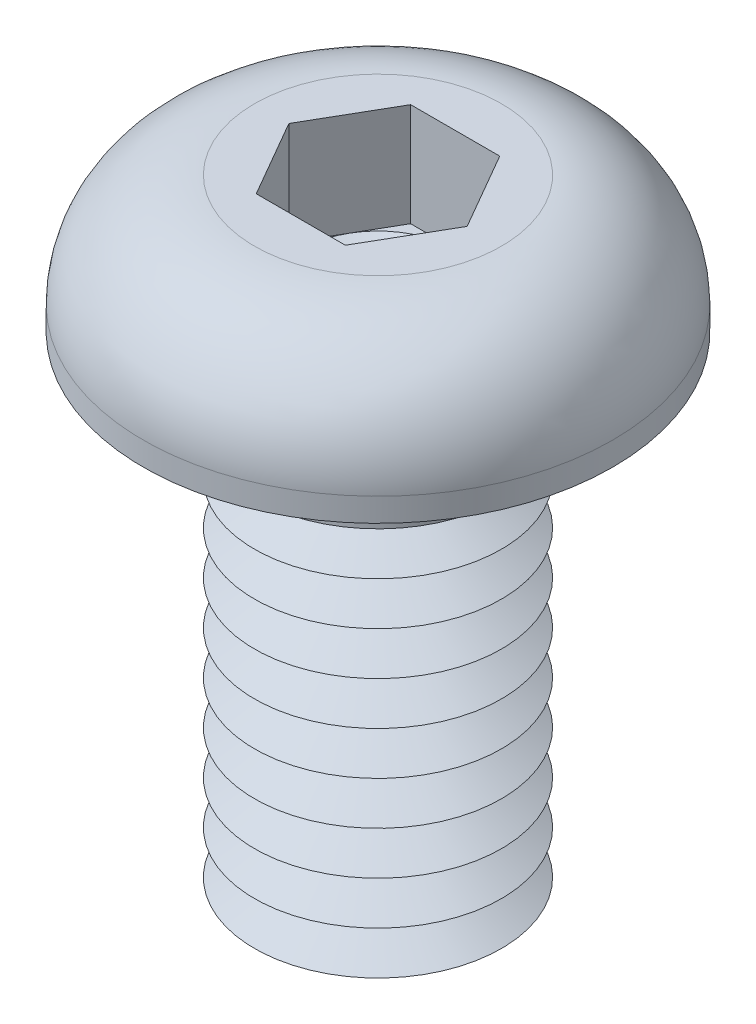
ISO-10303-21;
HEADER;
FILE_DESCRIPTION(('STEP AP214'),'2;1');
FILE_NAME('part.step','',(''),(''),'','','');
FILE_SCHEMA(('AUTOMOTIVE_DESIGN { 1 0 10303 214 1 1 1 1 }'));
ENDSEC;
DATA;
#1=APPLICATION_CONTEXT('core data for automotive mechanical design processes');
#2=APPLICATION_PROTOCOL_DEFINITION('international standard','automotive_design',2000,#1);
#3=PRODUCT_CONTEXT('',#1,'mechanical');
#4=PRODUCT('Part','Part','',(#3));
#5=PRODUCT_RELATED_PRODUCT_CATEGORY('part','',(#4));
#6=PRODUCT_DEFINITION_FORMATION('','',#4);
#7=PRODUCT_DEFINITION_CONTEXT('part definition',#1,'design');
#8=PRODUCT_DEFINITION('design','',#6,#7);
#9=PRODUCT_DEFINITION_SHAPE('','',#8);
#10=(LENGTH_UNIT() NAMED_UNIT(*) SI_UNIT(.MILLI.,.METRE.));
#11=(NAMED_UNIT(*) PLANE_ANGLE_UNIT() SI_UNIT($,.RADIAN.));
#12=(NAMED_UNIT(*) SI_UNIT($,.STERADIAN.) SOLID_ANGLE_UNIT());
#13=UNCERTAINTY_MEASURE_WITH_UNIT(LENGTH_MEASURE(1.E-05),#10,'distance_accuracy_value','');
#14=(GEOMETRIC_REPRESENTATION_CONTEXT(3) GLOBAL_UNCERTAINTY_ASSIGNED_CONTEXT((#13)) GLOBAL_UNIT_ASSIGNED_CONTEXT((#10,
#11,#12)) REPRESENTATION_CONTEXT('',''));
#15=CARTESIAN_POINT('',(0.,0.,0.));
#16=DIRECTION('',(0.,0.,1.));
#17=DIRECTION('',(1.,0.,0.));
#18=AXIS2_PLACEMENT_3D('',#15,#16,#17);
#19=CARTESIAN_POINT('',(0.,0.,0.));
#20=DIRECTION('',(0.,-1.,0.));
#21=DIRECTION('',(0.,0.,-1.));
#22=AXIS2_PLACEMENT_3D('',#19,#20,#21);
#23=TOROIDAL_SURFACE('',#22,2.35,0.35);
#24=CARTESIAN_POINT('',(0.,0.,-2.7));
#25=VERTEX_POINT('',#24);
#26=VERTEX_LOOP('',#25);
#27=FACE_BOUND('',#26,.T.);
#28=ADVANCED_FACE('P0_F12',(#27),#23,.T.);
#29=CLOSED_SHELL('',(#28));
#30=MANIFOLD_SOLID_BREP('P0_B1',#29);
#31=CARTESIAN_POINT('',(0.721687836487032,0.530000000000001,-1.25));
#32=DIRECTION('',(0.,1.,0.));
#33=DIRECTION('',(0.,0.,1.));
#34=AXIS2_PLACEMENT_3D('',#31,#32,#33);
#35=PLANE('',#34);
#36=CARTESIAN_POINT('',(0.,0.530000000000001,0.));
#37=DIRECTION('',(0.,1.,0.));
#38=DIRECTION('',(0.,0.,1.));
#39=AXIS2_PLACEMENT_3D('',#36,#37,#38);
#40=CIRCLE('',#39,1.25);
#41=CARTESIAN_POINT('',(0.,0.530000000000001,1.25));
#42=VERTEX_POINT('',#41);
#43=CARTESIAN_POINT('',(1.08253175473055,0.530000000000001,0.625));
#44=VERTEX_POINT('',#43);
#45=EDGE_CURVE('P1_E93',#42,#44,#40,.T.);
#46=ORIENTED_EDGE('',*,*,#45,.F.);
#47=DIRECTION('',(1.,0.,0.));
#48=VECTOR('',#47,1.);
#49=CARTESIAN_POINT('',(-0.721687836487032,0.530000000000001,1.25));
#50=LINE('',#49,#48);
#51=CARTESIAN_POINT('',(0.721687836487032,0.530000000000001,1.25));
#52=VERTEX_POINT('',#51);
#53=EDGE_CURVE('P1_E116',#42,#52,#50,.T.);
#54=ORIENTED_EDGE('',*,*,#53,.T.);
#55=DIRECTION('',(0.5,0.,-0.866025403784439));
#56=VECTOR('',#55,1.);
#57=CARTESIAN_POINT('',(0.721687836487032,0.530000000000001,1.25));
#58=LINE('',#57,#56);
#59=EDGE_CURVE('P1_E112',#52,#44,#58,.T.);
#60=ORIENTED_EDGE('',*,*,#59,.T.);
#61=EDGE_LOOP('',(#46,#54,#60));
#62=FACE_BOUND('',#61,.T.);
#63=ADVANCED_FACE('P1_F15',(#62),#35,.T.);
#64=CARTESIAN_POINT('',(0.,0.530000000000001,0.));
#65=DIRECTION('',(0.,1.,0.));
#66=DIRECTION('',(0.,0.,1.));
#67=AXIS2_PLACEMENT_3D('',#64,#65,#66);
#68=CIRCLE('',#67,1.25);
#69=CARTESIAN_POINT('',(1.08253175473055,0.530000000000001,-0.625));
#70=VERTEX_POINT('',#69);
#71=EDGE_CURVE('P1_E10',#44,#70,#68,.T.);
#72=ORIENTED_EDGE('',*,*,#71,.F.);
#73=CARTESIAN_POINT('',(1.44337567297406,0.530000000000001,0.));
#74=VERTEX_POINT('',#73);
#75=EDGE_CURVE('P1_E104',#44,#74,#58,.T.);
#76=ORIENTED_EDGE('',*,*,#75,.T.);
#77=DIRECTION('',(-0.5,0.,-0.866025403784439));
#78=VECTOR('',#77,1.);
#79=CARTESIAN_POINT('',(1.44337567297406,0.530000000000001,0.));
#80=LINE('',#79,#78);
#81=EDGE_CURVE('P1_E107',#74,#70,#80,.T.);
#82=ORIENTED_EDGE('',*,*,#81,.T.);
#83=EDGE_LOOP('',(#72,#76,#82));
#84=FACE_BOUND('',#83,.T.);
#85=ADVANCED_FACE('P1_F103',(#84),#35,.T.);
#86=CARTESIAN_POINT('',(0.,0.530000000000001,-1.25));
#87=VERTEX_POINT('',#86);
#88=EDGE_CURVE('P1_E24',#70,#87,#68,.T.);
#89=ORIENTED_EDGE('',*,*,#88,.F.);
#90=CARTESIAN_POINT('',(0.721687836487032,0.530000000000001,-1.25));
#91=VERTEX_POINT('',#90);
#92=EDGE_CURVE('P1_E139',#70,#91,#80,.T.);
#93=ORIENTED_EDGE('',*,*,#92,.T.);
#94=DIRECTION('',(-1.,0.,0.));
#95=VECTOR('',#94,1.);
#96=CARTESIAN_POINT('',(0.721687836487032,0.530000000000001,-1.25));
#97=LINE('',#96,#95);
#98=EDGE_CURVE('P1_E282',#91,#87,#97,.T.);
#99=ORIENTED_EDGE('',*,*,#98,.T.);
#100=EDGE_LOOP('',(#89,#93,#99));
#101=FACE_BOUND('',#100,.T.);
#102=ADVANCED_FACE('P1_F247',(#101),#35,.T.);
#103=CARTESIAN_POINT('',(-1.08253175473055,0.530000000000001,-0.625));
#104=VERTEX_POINT('',#103);
#105=EDGE_CURVE('P1_E277',#87,#104,#68,.T.);
#106=ORIENTED_EDGE('',*,*,#105,.F.);
#107=CARTESIAN_POINT('',(-0.721687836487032,0.530000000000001,-1.25));
#108=VERTEX_POINT('',#107);
#109=EDGE_CURVE('P1_E286',#87,#108,#97,.T.);
#110=ORIENTED_EDGE('',*,*,#109,.T.);
#111=DIRECTION('',(-0.5,0.,0.866025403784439));
#112=VECTOR('',#111,1.);
#113=CARTESIAN_POINT('',(-0.721687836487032,0.530000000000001,-1.25));
#114=LINE('',#113,#112);
#115=EDGE_CURVE('P1_E281',#108,#104,#114,.T.);
#116=ORIENTED_EDGE('',*,*,#115,.T.);
#117=EDGE_LOOP('',(#106,#110,#116));
#118=FACE_BOUND('',#117,.T.);
#119=ADVANCED_FACE('P1_F261',(#118),#35,.T.);
#120=CARTESIAN_POINT('',(-1.08253175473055,0.530000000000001,0.625));
#121=VERTEX_POINT('',#120);
#122=EDGE_CURVE('P1_E31',#104,#121,#68,.T.);
#123=ORIENTED_EDGE('',*,*,#122,.F.);
#124=CARTESIAN_POINT('',(-1.44337567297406,0.530000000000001,0.));
#125=VERTEX_POINT('',#124);
#126=EDGE_CURVE('P1_E273',#104,#125,#114,.T.);
#127=ORIENTED_EDGE('',*,*,#126,.T.);
#128=DIRECTION('',(0.5,0.,0.866025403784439));
#129=VECTOR('',#128,1.);
#130=CARTESIAN_POINT('',(-1.44337567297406,0.530000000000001,0.));
#131=LINE('',#130,#129);
#132=EDGE_CURVE('P1_E276',#125,#121,#131,.T.);
#133=ORIENTED_EDGE('',*,*,#132,.T.);
#134=EDGE_LOOP('',(#123,#127,#133));
#135=FACE_BOUND('',#134,.T.);
#136=ADVANCED_FACE('P1_F252',(#135),#35,.T.);
#137=CARTESIAN_POINT('',(0.,-7.3,0.));
#138=DIRECTION('',(0.,1.,0.));
#139=DIRECTION('',(0.,0.,1.));
#140=AXIS2_PLACEMENT_3D('',#137,#138,#139);
#141=CONICAL_SURFACE('',#140,1.39378221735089,1.0471975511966);
#142=CARTESIAN_POINT('',(0.,-6.95,0.));
#143=DIRECTION('',(0.,-1.,0.));
#144=DIRECTION('',(0.,0.,-1.));
#145=AXIS2_PLACEMENT_3D('',#142,#143,#144);
#146=CIRCLE('',#145,2.);
#147=CARTESIAN_POINT('',(0.,-6.95,-2.));
#148=VERTEX_POINT('',#147);
#149=EDGE_CURVE('P1_E209',#148,#148,#146,.T.);
#150=ORIENTED_EDGE('',*,*,#149,.T.);
#151=EDGE_LOOP('',(#150));
#152=FACE_BOUND('',#151,.T.);
#153=CARTESIAN_POINT('',(0.,-7.3,0.));
#154=DIRECTION('',(0.,-1.,0.));
#155=DIRECTION('',(0.,0.,-1.));
#156=AXIS2_PLACEMENT_3D('',#153,#154,#155);
#157=CIRCLE('',#156,1.39378221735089);
#158=CARTESIAN_POINT('',(0.,-7.3,-1.39378221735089));
#159=VERTEX_POINT('',#158);
#160=EDGE_CURVE('P1_E212',#159,#159,#157,.T.);
#161=ORIENTED_EDGE('',*,*,#160,.F.);
#162=EDGE_LOOP('',(#161));
#163=FACE_BOUND('',#162,.T.);
#164=ADVANCED_FACE('P1_F260',(#152,#163),#141,.T.);
#165=CARTESIAN_POINT('',(0.,-7.65,0.));
#166=DIRECTION('',(0.,-1.,0.));
#167=DIRECTION('',(0.,0.,-1.));
#168=AXIS2_PLACEMENT_3D('',#165,#166,#167);
#169=CONICAL_SURFACE('',#168,2.,1.0471975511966);
#170=ORIENTED_EDGE('',*,*,#160,.T.);
#171=EDGE_LOOP('',(#170));
#172=FACE_BOUND('',#171,.T.);
#173=CARTESIAN_POINT('',(0.,-7.65,0.));
#174=DIRECTION('',(0.,-1.,0.));
#175=DIRECTION('',(0.,0.,-1.));
#176=AXIS2_PLACEMENT_3D('',#173,#174,#175);
#177=CIRCLE('',#176,2.);
#178=CARTESIAN_POINT('',(0.,-7.65,-2.));
#179=VERTEX_POINT('',#178);
#180=EDGE_CURVE('P1_E215',#179,#179,#177,.T.);
#181=ORIENTED_EDGE('',*,*,#180,.F.);
#182=EDGE_LOOP('',(#181));
#183=FACE_BOUND('',#182,.T.);
#184=ADVANCED_FACE('P1_F267',(#172,#183),#169,.T.);
#185=CARTESIAN_POINT('',(0.,-8.,0.));
#186=DIRECTION('',(0.,1.,0.));
#187=DIRECTION('',(0.,0.,1.));
#188=AXIS2_PLACEMENT_3D('',#185,#186,#187);
#189=PLANE('',#188);
#190=CARTESIAN_POINT('',(0.,-8.,0.));
#191=DIRECTION('',(0.,-1.,0.));
#192=DIRECTION('',(0.,0.,-1.));
#193=AXIS2_PLACEMENT_3D('',#190,#191,#192);
#194=CIRCLE('',#193,1.39378221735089);
#195=CARTESIAN_POINT('',(0.,-8.,-1.39378221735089));
#196=VERTEX_POINT('',#195);
#197=EDGE_CURVE('P1_E218',#196,#196,#194,.T.);
#198=ORIENTED_EDGE('',*,*,#197,.T.);
#199=EDGE_LOOP('',(#198));
#200=FACE_BOUND('',#199,.T.);
#201=ADVANCED_FACE('P1_F345',(#200),#189,.F.);
#202=CARTESIAN_POINT('',(0.,-8.,0.));
#203=DIRECTION('',(0.,1.,0.));
#204=DIRECTION('',(0.,0.,1.));
#205=AXIS2_PLACEMENT_3D('',#202,#203,#204);
#206=CONICAL_SURFACE('',#205,1.39378221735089,1.0471975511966);
#207=ORIENTED_EDGE('',*,*,#180,.T.);
#208=EDGE_LOOP('',(#207));
#209=FACE_BOUND('',#208,.T.);
#210=ORIENTED_EDGE('',*,*,#197,.F.);
#211=EDGE_LOOP('',(#210));
#212=FACE_BOUND('',#211,.T.);
#213=ADVANCED_FACE('P1_F356',(#209,#212),#206,.T.);
#214=CARTESIAN_POINT('',(0.,-6.6,0.));
#215=DIRECTION('',(0.,1.,0.));
#216=DIRECTION('',(0.,0.,1.));
#217=AXIS2_PLACEMENT_3D('',#214,#215,#216);
#218=CONICAL_SURFACE('',#217,1.39378221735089,1.0471975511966);
#219=CARTESIAN_POINT('',(0.,-6.25,0.));
#220=DIRECTION('',(0.,-1.,0.));
#221=DIRECTION('',(0.,0.,-1.));
#222=AXIS2_PLACEMENT_3D('',#219,#220,#221);
#223=CIRCLE('',#222,2.);
#224=CARTESIAN_POINT('',(0.,-6.25,-2.));
#225=VERTEX_POINT('',#224);
#226=EDGE_CURVE('P1_E203',#225,#225,#223,.T.);
#227=ORIENTED_EDGE('',*,*,#226,.T.);
#228=EDGE_LOOP('',(#227));
#229=FACE_BOUND('',#228,.T.);
#230=CARTESIAN_POINT('',(0.,-6.6,0.));
#231=DIRECTION('',(0.,-1.,0.));
#232=DIRECTION('',(0.,0.,-1.));
#233=AXIS2_PLACEMENT_3D('',#230,#231,#232);
#234=CIRCLE('',#233,1.39378221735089);
#235=CARTESIAN_POINT('',(0.,-6.6,-1.39378221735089));
#236=VERTEX_POINT('',#235);
#237=EDGE_CURVE('P1_E206',#236,#236,#234,.T.);
#238=ORIENTED_EDGE('',*,*,#237,.F.);
#239=EDGE_LOOP('',(#238));
#240=FACE_BOUND('',#239,.T.);
#241=ADVANCED_FACE('P1_F365',(#229,#240),#218,.T.);
#242=CARTESIAN_POINT('',(0.,-6.95,0.));
#243=DIRECTION('',(0.,-1.,0.));
#244=DIRECTION('',(0.,0.,-1.));
#245=AXIS2_PLACEMENT_3D('',#242,#243,#244);
#246=CONICAL_SURFACE('',#245,2.,1.0471975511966);
#247=ORIENTED_EDGE('',*,*,#237,.T.);
#248=EDGE_LOOP('',(#247));
#249=FACE_BOUND('',#248,.T.);
#250=ORIENTED_EDGE('',*,*,#149,.F.);
#251=EDGE_LOOP('',(#250));
#252=FACE_BOUND('',#251,.T.);
#253=ADVANCED_FACE('P1_F374',(#249,#252),#246,.T.);
#254=CARTESIAN_POINT('',(0.,-5.9,0.));
#255=DIRECTION('',(0.,1.,0.));
#256=DIRECTION('',(0.,0.,1.));
#257=AXIS2_PLACEMENT_3D('',#254,#255,#256);
#258=CONICAL_SURFACE('',#257,1.39378221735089,1.0471975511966);
#259=CARTESIAN_POINT('',(0.,-5.55,0.));
#260=DIRECTION('',(0.,-1.,0.));
#261=DIRECTION('',(0.,0.,-1.));
#262=AXIS2_PLACEMENT_3D('',#259,#260,#261);
#263=CIRCLE('',#262,2.);
#264=CARTESIAN_POINT('',(0.,-5.55,-2.));
#265=VERTEX_POINT('',#264);
#266=EDGE_CURVE('P1_E197',#265,#265,#263,.T.);
#267=ORIENTED_EDGE('',*,*,#266,.T.);
#268=EDGE_LOOP('',(#267));
#269=FACE_BOUND('',#268,.T.);
#270=CARTESIAN_POINT('',(0.,-5.9,0.));
#271=DIRECTION('',(0.,-1.,0.));
#272=DIRECTION('',(0.,0.,-1.));
#273=AXIS2_PLACEMENT_3D('',#270,#271,#272);
#274=CIRCLE('',#273,1.39378221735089);
#275=CARTESIAN_POINT('',(0.,-5.9,-1.39378221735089));
#276=VERTEX_POINT('',#275);
#277=EDGE_CURVE('P1_E200',#276,#276,#274,.T.);
#278=ORIENTED_EDGE('',*,*,#277,.F.);
#279=EDGE_LOOP('',(#278));
#280=FACE_BOUND('',#279,.T.);
#281=ADVANCED_FACE('P1_F384',(#269,#280),#258,.T.);
#282=CARTESIAN_POINT('',(0.,-6.25,0.));
#283=DIRECTION('',(0.,-1.,0.));
#284=DIRECTION('',(0.,0.,-1.));
#285=AXIS2_PLACEMENT_3D('',#282,#283,#284);
#286=CONICAL_SURFACE('',#285,2.,1.0471975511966);
#287=ORIENTED_EDGE('',*,*,#277,.T.);
#288=EDGE_LOOP('',(#287));
#289=FACE_BOUND('',#288,.T.);
#290=ORIENTED_EDGE('',*,*,#226,.F.);
#291=EDGE_LOOP('',(#290));
#292=FACE_BOUND('',#291,.T.);
#293=ADVANCED_FACE('P1_F394',(#289,#292),#286,.T.);
#294=CARTESIAN_POINT('',(0.,-5.2,0.));
#295=DIRECTION('',(0.,1.,0.));
#296=DIRECTION('',(0.,0.,1.));
#297=AXIS2_PLACEMENT_3D('',#294,#295,#296);
#298=CONICAL_SURFACE('',#297,1.39378221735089,1.0471975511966);
#299=CARTESIAN_POINT('',(0.,-4.85,0.));
#300=DIRECTION('',(0.,-1.,0.));
#301=DIRECTION('',(0.,0.,-1.));
#302=AXIS2_PLACEMENT_3D('',#299,#300,#301);
#303=CIRCLE('',#302,2.);
#304=CARTESIAN_POINT('',(0.,-4.85,-2.));
#305=VERTEX_POINT('',#304);
#306=EDGE_CURVE('P1_E191',#305,#305,#303,.T.);
#307=ORIENTED_EDGE('',*,*,#306,.T.);
#308=EDGE_LOOP('',(#307));
#309=FACE_BOUND('',#308,.T.);
#310=CARTESIAN_POINT('',(0.,-5.2,0.));
#311=DIRECTION('',(0.,-1.,0.));
#312=DIRECTION('',(0.,0.,-1.));
#313=AXIS2_PLACEMENT_3D('',#310,#311,#312);
#314=CIRCLE('',#313,1.39378221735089);
#315=CARTESIAN_POINT('',(0.,-5.2,-1.39378221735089));
#316=VERTEX_POINT('',#315);
#317=EDGE_CURVE('P1_E194',#316,#316,#314,.T.);
#318=ORIENTED_EDGE('',*,*,#317,.F.);
#319=EDGE_LOOP('',(#318));
#320=FACE_BOUND('',#319,.T.);
#321=ADVANCED_FACE('P1_F404',(#309,#320),#298,.T.);
#322=CARTESIAN_POINT('',(0.,-5.55,0.));
#323=DIRECTION('',(0.,-1.,0.));
#324=DIRECTION('',(0.,0.,-1.));
#325=AXIS2_PLACEMENT_3D('',#322,#323,#324);
#326=CONICAL_SURFACE('',#325,2.,1.0471975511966);
#327=ORIENTED_EDGE('',*,*,#317,.T.);
#328=EDGE_LOOP('',(#327));
#329=FACE_BOUND('',#328,.T.);
#330=ORIENTED_EDGE('',*,*,#266,.F.);
#331=EDGE_LOOP('',(#330));
#332=FACE_BOUND('',#331,.T.);
#333=ADVANCED_FACE('P1_F414',(#329,#332),#326,.T.);
#334=CARTESIAN_POINT('',(0.,-4.5,0.));
#335=DIRECTION('',(0.,1.,0.));
#336=DIRECTION('',(0.,0.,1.));
#337=AXIS2_PLACEMENT_3D('',#334,#335,#336);
#338=CONICAL_SURFACE('',#337,1.39378221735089,1.0471975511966);
#339=CARTESIAN_POINT('',(0.,-4.15,0.));
#340=DIRECTION('',(0.,-1.,0.));
#341=DIRECTION('',(0.,0.,-1.));
#342=AXIS2_PLACEMENT_3D('',#339,#340,#341);
#343=CIRCLE('',#342,2.);
#344=CARTESIAN_POINT('',(0.,-4.15,-2.));
#345=VERTEX_POINT('',#344);
#346=EDGE_CURVE('P1_E185',#345,#345,#343,.T.);
#347=ORIENTED_EDGE('',*,*,#346,.T.);
#348=EDGE_LOOP('',(#347));
#349=FACE_BOUND('',#348,.T.);
#350=CARTESIAN_POINT('',(0.,-4.5,0.));
#351=DIRECTION('',(0.,-1.,0.));
#352=DIRECTION('',(0.,0.,-1.));
#353=AXIS2_PLACEMENT_3D('',#350,#351,#352);
#354=CIRCLE('',#353,1.39378221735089);
#355=CARTESIAN_POINT('',(0.,-4.5,-1.39378221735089));
#356=VERTEX_POINT('',#355);
#357=EDGE_CURVE('P1_E188',#356,#356,#354,.T.);
#358=ORIENTED_EDGE('',*,*,#357,.F.);
#359=EDGE_LOOP('',(#358));
#360=FACE_BOUND('',#359,.T.);
#361=ADVANCED_FACE('P1_F424',(#349,#360),#338,.T.);
#362=CARTESIAN_POINT('',(0.,-4.85,0.));
#363=DIRECTION('',(0.,-1.,0.));
#364=DIRECTION('',(0.,0.,-1.));
#365=AXIS2_PLACEMENT_3D('',#362,#363,#364);
#366=CONICAL_SURFACE('',#365,2.,1.0471975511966);
#367=ORIENTED_EDGE('',*,*,#357,.T.);
#368=EDGE_LOOP('',(#367));
#369=FACE_BOUND('',#368,.T.);
#370=ORIENTED_EDGE('',*,*,#306,.F.);
#371=EDGE_LOOP('',(#370));
#372=FACE_BOUND('',#371,.T.);
#373=ADVANCED_FACE('P1_F434',(#369,#372),#366,.T.);
#374=CARTESIAN_POINT('',(0.,-3.8,0.));
#375=DIRECTION('',(0.,1.,0.));
#376=DIRECTION('',(0.,0.,1.));
#377=AXIS2_PLACEMENT_3D('',#374,#375,#376);
#378=CONICAL_SURFACE('',#377,1.39378221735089,1.0471975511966);
#379=CARTESIAN_POINT('',(0.,-3.45,0.));
#380=DIRECTION('',(0.,-1.,0.));
#381=DIRECTION('',(0.,0.,-1.));
#382=AXIS2_PLACEMENT_3D('',#379,#380,#381);
#383=CIRCLE('',#382,2.);
#384=CARTESIAN_POINT('',(0.,-3.45,-2.));
#385=VERTEX_POINT('',#384);
#386=EDGE_CURVE('P1_E179',#385,#385,#383,.T.);
#387=ORIENTED_EDGE('',*,*,#386,.T.);
#388=EDGE_LOOP('',(#387));
#389=FACE_BOUND('',#388,.T.);
#390=CARTESIAN_POINT('',(0.,-3.8,0.));
#391=DIRECTION('',(0.,-1.,0.));
#392=DIRECTION('',(0.,0.,-1.));
#393=AXIS2_PLACEMENT_3D('',#390,#391,#392);
#394=CIRCLE('',#393,1.39378221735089);
#395=CARTESIAN_POINT('',(0.,-3.8,-1.39378221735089));
#396=VERTEX_POINT('',#395);
#397=EDGE_CURVE('P1_E182',#396,#396,#394,.T.);
#398=ORIENTED_EDGE('',*,*,#397,.F.);
#399=EDGE_LOOP('',(#398));
#400=FACE_BOUND('',#399,.T.);
#401=ADVANCED_FACE('P1_F444',(#389,#400),#378,.T.);
#402=CARTESIAN_POINT('',(0.,-4.15,0.));
#403=DIRECTION('',(0.,-1.,0.));
#404=DIRECTION('',(0.,0.,-1.));
#405=AXIS2_PLACEMENT_3D('',#402,#403,#404);
#406=CONICAL_SURFACE('',#405,2.,1.0471975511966);
#407=ORIENTED_EDGE('',*,*,#397,.T.);
#408=EDGE_LOOP('',(#407));
#409=FACE_BOUND('',#408,.T.);
#410=ORIENTED_EDGE('',*,*,#346,.F.);
#411=EDGE_LOOP('',(#410));
#412=FACE_BOUND('',#411,.T.);
#413=ADVANCED_FACE('P1_F454',(#409,#412),#406,.T.);
#414=CARTESIAN_POINT('',(0.,-3.1,0.));
#415=DIRECTION('',(0.,1.,0.));
#416=DIRECTION('',(0.,0.,1.));
#417=AXIS2_PLACEMENT_3D('',#414,#415,#416);
#418=CONICAL_SURFACE('',#417,1.39378221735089,1.0471975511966);
#419=CARTESIAN_POINT('',(0.,-2.75,0.));
#420=DIRECTION('',(0.,-1.,0.));
#421=DIRECTION('',(0.,0.,-1.));
#422=AXIS2_PLACEMENT_3D('',#419,#420,#421);
#423=CIRCLE('',#422,2.);
#424=CARTESIAN_POINT('',(0.,-2.75,-2.));
#425=VERTEX_POINT('',#424);
#426=EDGE_CURVE('P1_E173',#425,#425,#423,.T.);
#427=ORIENTED_EDGE('',*,*,#426,.T.);
#428=EDGE_LOOP('',(#427));
#429=FACE_BOUND('',#428,.T.);
#430=CARTESIAN_POINT('',(0.,-3.1,0.));
#431=DIRECTION('',(0.,-1.,0.));
#432=DIRECTION('',(0.,0.,-1.));
#433=AXIS2_PLACEMENT_3D('',#430,#431,#432);
#434=CIRCLE('',#433,1.39378221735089);
#435=CARTESIAN_POINT('',(0.,-3.1,-1.39378221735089));
#436=VERTEX_POINT('',#435);
#437=EDGE_CURVE('P1_E176',#436,#436,#434,.T.);
#438=ORIENTED_EDGE('',*,*,#437,.F.);
#439=EDGE_LOOP('',(#438));
#440=FACE_BOUND('',#439,.T.);
#441=ADVANCED_FACE('P1_F464',(#429,#440),#418,.T.);
#442=CARTESIAN_POINT('',(0.,-3.45,0.));
#443=DIRECTION('',(0.,-1.,0.));
#444=DIRECTION('',(0.,0.,-1.));
#445=AXIS2_PLACEMENT_3D('',#442,#443,#444);
#446=CONICAL_SURFACE('',#445,2.,1.0471975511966);
#447=ORIENTED_EDGE('',*,*,#437,.T.);
#448=EDGE_LOOP('',(#447));
#449=FACE_BOUND('',#448,.T.);
#450=ORIENTED_EDGE('',*,*,#386,.F.);
#451=EDGE_LOOP('',(#450));
#452=FACE_BOUND('',#451,.T.);
#453=ADVANCED_FACE('P1_F474',(#449,#452),#446,.T.);
#454=CARTESIAN_POINT('',(0.,-2.4,0.));
#455=DIRECTION('',(0.,1.,0.));
#456=DIRECTION('',(0.,0.,1.));
#457=AXIS2_PLACEMENT_3D('',#454,#455,#456);
#458=CONICAL_SURFACE('',#457,1.39378221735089,1.0471975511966);
#459=CARTESIAN_POINT('',(0.,-2.05,0.));
#460=DIRECTION('',(0.,-1.,0.));
#461=DIRECTION('',(0.,0.,-1.));
#462=AXIS2_PLACEMENT_3D('',#459,#460,#461);
#463=CIRCLE('',#462,2.);
#464=CARTESIAN_POINT('',(0.,-2.05,-2.));
#465=VERTEX_POINT('',#464);
#466=EDGE_CURVE('P1_E164',#465,#465,#463,.T.);
#467=ORIENTED_EDGE('',*,*,#466,.T.);
#468=EDGE_LOOP('',(#467));
#469=FACE_BOUND('',#468,.T.);
#470=CARTESIAN_POINT('',(0.,-2.4,0.));
#471=DIRECTION('',(0.,-1.,0.));
#472=DIRECTION('',(0.,0.,-1.));
#473=AXIS2_PLACEMENT_3D('',#470,#471,#472);
#474=CIRCLE('',#473,1.39378221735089);
#475=CARTESIAN_POINT('',(0.,-2.4,-1.39378221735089));
#476=VERTEX_POINT('',#475);
#477=EDGE_CURVE('P1_E170',#476,#476,#474,.T.);
#478=ORIENTED_EDGE('',*,*,#477,.F.);
#479=EDGE_LOOP('',(#478));
#480=FACE_BOUND('',#479,.T.);
#481=ADVANCED_FACE('P1_F484',(#469,#480),#458,.T.);
#482=CARTESIAN_POINT('',(0.,-2.75,0.));
#483=DIRECTION('',(0.,-1.,0.));
#484=DIRECTION('',(0.,0.,-1.));
#485=AXIS2_PLACEMENT_3D('',#482,#483,#484);
#486=CONICAL_SURFACE('',#485,2.,1.0471975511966);
#487=ORIENTED_EDGE('',*,*,#477,.T.);
#488=EDGE_LOOP('',(#487));
#489=FACE_BOUND('',#488,.T.);
#490=ORIENTED_EDGE('',*,*,#426,.F.);
#491=EDGE_LOOP('',(#490));
#492=FACE_BOUND('',#491,.T.);
#493=ADVANCED_FACE('P1_F494',(#489,#492),#486,.T.);
#494=CARTESIAN_POINT('',(0.,-1.7,0.));
#495=DIRECTION('',(0.,1.,0.));
#496=DIRECTION('',(0.,0.,1.));
#497=AXIS2_PLACEMENT_3D('',#494,#495,#496);
#498=CONICAL_SURFACE('',#497,1.39378221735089,1.0471975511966);
#499=CARTESIAN_POINT('',(0.,-1.35,0.));
#500=DIRECTION('',(0.,-1.,0.));
#501=DIRECTION('',(0.,0.,-1.));
#502=AXIS2_PLACEMENT_3D('',#499,#500,#501);
#503=CIRCLE('',#502,2.);
#504=CARTESIAN_POINT('',(0.,-1.35,-2.));
#505=VERTEX_POINT('',#504);
#506=EDGE_CURVE('P1_E167',#505,#505,#503,.T.);
#507=ORIENTED_EDGE('',*,*,#506,.T.);
#508=EDGE_LOOP('',(#507));
#509=FACE_BOUND('',#508,.T.);
#510=CARTESIAN_POINT('',(0.,-1.7,0.));
#511=DIRECTION('',(0.,-1.,0.));
#512=DIRECTION('',(0.,0.,-1.));
#513=AXIS2_PLACEMENT_3D('',#510,#511,#512);
#514=CIRCLE('',#513,1.39378221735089);
#515=CARTESIAN_POINT('',(0.,-1.7,-1.39378221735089));
#516=VERTEX_POINT('',#515);
#517=EDGE_CURVE('P1_E161',#516,#516,#514,.T.);
#518=ORIENTED_EDGE('',*,*,#517,.F.);
#519=EDGE_LOOP('',(#518));
#520=FACE_BOUND('',#519,.T.);
#521=ADVANCED_FACE('P1_F504',(#509,#520),#498,.T.);
#522=CARTESIAN_POINT('',(0.,-2.05,0.));
#523=DIRECTION('',(0.,-1.,0.));
#524=DIRECTION('',(0.,0.,-1.));
#525=AXIS2_PLACEMENT_3D('',#522,#523,#524);
#526=CONICAL_SURFACE('',#525,2.,1.0471975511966);
#527=ORIENTED_EDGE('',*,*,#517,.T.);
#528=EDGE_LOOP('',(#527));
#529=FACE_BOUND('',#528,.T.);
#530=ORIENTED_EDGE('',*,*,#466,.F.);
#531=EDGE_LOOP('',(#530));
#532=FACE_BOUND('',#531,.T.);
#533=ADVANCED_FACE('P1_F514',(#529,#532),#526,.T.);
#534=CARTESIAN_POINT('',(0.,-8.,0.));
#535=DIRECTION('',(0.,1.,0.));
#536=DIRECTION('',(0.,0.,1.));
#537=AXIS2_PLACEMENT_3D('',#534,#535,#536);
#538=CYLINDRICAL_SURFACE('',#537,2.);
#539=CARTESIAN_POINT('',(0.,0.,0.));
#540=DIRECTION('',(0.,-1.,0.));
#541=DIRECTION('',(1.,0.,0.));
#542=AXIS2_PLACEMENT_3D('',#539,#540,#541);
#543=CIRCLE('',#542,2.);
#544=CARTESIAN_POINT('',(2.,0.,0.));
#545=VERTEX_POINT('',#544);
#546=EDGE_CURVE('P1_E141',#545,#545,#543,.F.);
#547=ORIENTED_EDGE('',*,*,#546,.F.);
#548=EDGE_LOOP('',(#547));
#549=FACE_BOUND('',#548,.T.);
#550=ORIENTED_EDGE('',*,*,#506,.F.);
#551=EDGE_LOOP('',(#550));
#552=FACE_BOUND('',#551,.T.);
#553=ADVANCED_FACE('P1_F17',(#549,#552),#538,.T.);
#554=CARTESIAN_POINT('',(0.,0.,0.));
#555=DIRECTION('',(0.,-1.,0.));
#556=DIRECTION('',(0.,0.,-1.));
#557=AXIS2_PLACEMENT_3D('',#554,#555,#556);
#558=TOROIDAL_SURFACE('',#557,2.35,0.35);
#559=ORIENTED_EDGE('',*,*,#546,.T.);
#560=EDGE_LOOP('',(#559));
#561=FACE_BOUND('',#560,.T.);
#562=CARTESIAN_POINT('',(0.,0.,0.));
#563=DIRECTION('',(0.,1.,0.));
#564=DIRECTION('',(-1.,0.,0.));
#565=AXIS2_PLACEMENT_3D('',#562,#563,#564);
#566=CIRCLE('',#565,2.7);
#567=CARTESIAN_POINT('',(-2.7,0.,0.));
#568=VERTEX_POINT('',#567);
#569=EDGE_CURVE('P1_E151',#568,#568,#566,.F.);
#570=ORIENTED_EDGE('',*,*,#569,.T.);
#571=EDGE_LOOP('',(#570));
#572=FACE_BOUND('',#571,.T.);
#573=ADVANCED_FACE('P1_F223',(#561,#572),#558,.F.);
#574=CARTESIAN_POINT('',(2.,2.2,0.));
#575=DIRECTION('',(0.,-1.,0.));
#576=DIRECTION('',(1.,0.,0.));
#577=AXIS2_PLACEMENT_3D('',#574,#575,#576);
#578=PLANE('',#577);
#579=DIRECTION('',(-1.,0.,0.));
#580=VECTOR('',#579,1.);
#581=CARTESIAN_POINT('',(0.721687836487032,2.2,-1.25));
#582=LINE('',#581,#580);
#583=CARTESIAN_POINT('',(0.721687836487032,2.2,-1.25));
#584=VERTEX_POINT('',#583);
#585=CARTESIAN_POINT('',(-0.721687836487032,2.2,-1.25));
#586=VERTEX_POINT('',#585);
#587=EDGE_CURVE('P1_E125',#584,#586,#582,.T.);
#588=ORIENTED_EDGE('',*,*,#587,.F.);
#589=DIRECTION('',(-0.5,0.,-0.866025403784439));
#590=VECTOR('',#589,1.);
#591=CARTESIAN_POINT('',(1.44337567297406,2.2,0.));
#592=LINE('',#591,#590);
#593=CARTESIAN_POINT('',(1.44337567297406,2.2,0.));
#594=VERTEX_POINT('',#593);
#595=EDGE_CURVE('P1_E39',#594,#584,#592,.T.);
#596=ORIENTED_EDGE('',*,*,#595,.F.);
#597=DIRECTION('',(0.5,0.,-0.866025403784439));
#598=VECTOR('',#597,1.);
#599=CARTESIAN_POINT('',(0.721687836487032,2.2,1.25));
#600=LINE('',#599,#598);
#601=CARTESIAN_POINT('',(0.721687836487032,2.2,1.25));
#602=VERTEX_POINT('',#601);
#603=EDGE_CURVE('P1_E137',#602,#594,#600,.T.);
#604=ORIENTED_EDGE('',*,*,#603,.F.);
#605=DIRECTION('',(1.,0.,0.));
#606=VECTOR('',#605,1.);
#607=CARTESIAN_POINT('',(-0.721687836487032,2.2,1.25));
#608=LINE('',#607,#606);
#609=CARTESIAN_POINT('',(-0.721687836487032,2.2,1.25));
#610=VERTEX_POINT('',#609);
#611=EDGE_CURVE('P1_E134',#610,#602,#608,.T.);
#612=ORIENTED_EDGE('',*,*,#611,.F.);
#613=DIRECTION('',(0.5,0.,0.866025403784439));
#614=VECTOR('',#613,1.);
#615=CARTESIAN_POINT('',(-1.44337567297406,2.2,0.));
#616=LINE('',#615,#614);
#617=CARTESIAN_POINT('',(-1.44337567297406,2.2,0.));
#618=VERTEX_POINT('',#617);
#619=EDGE_CURVE('P1_E131',#618,#610,#616,.T.);
#620=ORIENTED_EDGE('',*,*,#619,.F.);
#621=DIRECTION('',(-0.5,0.,0.866025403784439));
#622=VECTOR('',#621,1.);
#623=CARTESIAN_POINT('',(-0.721687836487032,2.2,-1.25));
#624=LINE('',#623,#622);
#625=EDGE_CURVE('P1_E128',#586,#618,#624,.T.);
#626=ORIENTED_EDGE('',*,*,#625,.F.);
#627=EDGE_LOOP('',(#588,#596,#604,#612,#620,#626));
#628=FACE_BOUND('',#627,.T.);
#629=CARTESIAN_POINT('',(0.,2.2,0.));
#630=DIRECTION('',(0.,1.,0.));
#631=DIRECTION('',(-1.,0.,0.));
#632=AXIS2_PLACEMENT_3D('',#629,#630,#631);
#633=CIRCLE('',#632,2.);
#634=CARTESIAN_POINT('',(-2.,2.2,0.));
#635=VERTEX_POINT('',#634);
#636=EDGE_CURVE('P1_E152',#635,#635,#633,.T.);
#637=ORIENTED_EDGE('',*,*,#636,.T.);
#638=EDGE_LOOP('',(#637));
#639=FACE_BOUND('',#638,.T.);
#640=ADVANCED_FACE('P1_F301',(#628,#639),#578,.F.);
#641=CARTESIAN_POINT('',(0.,0.38,0.));
#642=DIRECTION('',(0.,1.,0.));
#643=DIRECTION('',(-1.,0.,0.));
#644=AXIS2_PLACEMENT_3D('',#641,#642,#643);
#645=TOROIDAL_SURFACE('',#644,1.97988888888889,1.82011111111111);
#646=ORIENTED_EDGE('',*,*,#636,.F.);
#647=EDGE_LOOP('',(#646));
#648=FACE_BOUND('',#647,.T.);
#649=CARTESIAN_POINT('',(0.,0.38,0.));
#650=DIRECTION('',(0.,1.,0.));
#651=DIRECTION('',(-1.,0.,0.));
#652=AXIS2_PLACEMENT_3D('',#649,#650,#651);
#653=CIRCLE('',#652,3.8);
#654=CARTESIAN_POINT('',(-3.8,0.38,0.));
#655=VERTEX_POINT('',#654);
#656=EDGE_CURVE('P1_E155',#655,#655,#653,.T.);
#657=ORIENTED_EDGE('',*,*,#656,.T.);
#658=EDGE_LOOP('',(#657));
#659=FACE_BOUND('',#658,.T.);
#660=ADVANCED_FACE('P1_F237',(#648,#659),#645,.T.);
#661=CARTESIAN_POINT('',(0.,2.2,0.));
#662=DIRECTION('',(0.,1.,0.));
#663=DIRECTION('',(-1.,0.,0.));
#664=AXIS2_PLACEMENT_3D('',#661,#662,#663);
#665=CYLINDRICAL_SURFACE('',#664,3.8);
#666=ORIENTED_EDGE('',*,*,#656,.F.);
#667=EDGE_LOOP('',(#666));
#668=FACE_BOUND('',#667,.T.);
#669=CARTESIAN_POINT('',(0.,0.,0.));
#670=DIRECTION('',(0.,1.,0.));
#671=DIRECTION('',(-1.,0.,0.));
#672=AXIS2_PLACEMENT_3D('',#669,#670,#671);
#673=CIRCLE('',#672,3.8);
#674=CARTESIAN_POINT('',(-3.8,0.,0.));
#675=VERTEX_POINT('',#674);
#676=EDGE_CURVE('P1_E158',#675,#675,#673,.T.);
#677=ORIENTED_EDGE('',*,*,#676,.T.);
#678=EDGE_LOOP('',(#677));
#679=FACE_BOUND('',#678,.T.);
#680=ADVANCED_FACE('P1_F228',(#668,#679),#665,.T.);
#681=CARTESIAN_POINT('',(0.,0.,0.));
#682=DIRECTION('',(0.,1.,0.));
#683=DIRECTION('',(-1.,0.,0.));
#684=AXIS2_PLACEMENT_3D('',#681,#682,#683);
#685=PLANE('',#684);
#686=ORIENTED_EDGE('',*,*,#676,.F.);
#687=EDGE_LOOP('',(#686));
#688=FACE_BOUND('',#687,.T.);
#689=ORIENTED_EDGE('',*,*,#569,.F.);
#690=EDGE_LOOP('',(#689));
#691=FACE_BOUND('',#690,.T.);
#692=ADVANCED_FACE('P1_F225',(#688,#691),#685,.F.);
#693=CARTESIAN_POINT('',(1.44337567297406,0.530000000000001,0.));
#694=DIRECTION('',(0.866025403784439,0.,-0.5));
#695=DIRECTION('',(-0.5,0.,-0.866025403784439));
#696=AXIS2_PLACEMENT_3D('',#693,#694,#695);
#697=PLANE('',#696);
#698=ORIENTED_EDGE('',*,*,#595,.T.);
#699=DIRECTION('',(0.,1.,0.));
#700=VECTOR('',#699,1.);
#701=CARTESIAN_POINT('',(0.721687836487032,0.530000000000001,-1.25));
#702=LINE('',#701,#700);
#703=EDGE_CURVE('P1_E118',#91,#584,#702,.T.);
#704=ORIENTED_EDGE('',*,*,#703,.F.);
#705=ORIENTED_EDGE('',*,*,#92,.F.);
#706=ORIENTED_EDGE('',*,*,#81,.F.);
#707=DIRECTION('',(0.,1.,0.));
#708=VECTOR('',#707,1.);
#709=CARTESIAN_POINT('',(1.44337567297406,0.530000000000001,0.));
#710=LINE('',#709,#708);
#711=EDGE_CURVE('P1_E113',#74,#594,#710,.T.);
#712=ORIENTED_EDGE('',*,*,#711,.T.);
#713=EDGE_LOOP('',(#698,#704,#705,#706,#712));
#714=FACE_BOUND('',#713,.T.);
#715=ADVANCED_FACE('P1_F227',(#714),#697,.F.);
#716=CARTESIAN_POINT('',(0.721687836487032,0.530000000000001,1.25));
#717=DIRECTION('',(0.866025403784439,0.,0.5));
#718=DIRECTION('',(0.5,0.,-0.866025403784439));
#719=AXIS2_PLACEMENT_3D('',#716,#717,#718);
#720=PLANE('',#719);
#721=ORIENTED_EDGE('',*,*,#603,.T.);
#722=ORIENTED_EDGE('',*,*,#711,.F.);
#723=ORIENTED_EDGE('',*,*,#75,.F.);
#724=ORIENTED_EDGE('',*,*,#59,.F.);
#725=DIRECTION('',(0.,1.,0.));
#726=VECTOR('',#725,1.);
#727=CARTESIAN_POINT('',(0.721687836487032,0.530000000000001,1.25));
#728=LINE('',#727,#726);
#729=EDGE_CURVE('P1_E142',#52,#602,#728,.T.);
#730=ORIENTED_EDGE('',*,*,#729,.T.);
#731=EDGE_LOOP('',(#721,#722,#723,#724,#730));
#732=FACE_BOUND('',#731,.T.);
#733=ADVANCED_FACE('P1_F111',(#732),#720,.F.);
#734=CARTESIAN_POINT('',(-0.721687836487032,0.530000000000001,1.25));
#735=DIRECTION('',(0.,0.,1.));
#736=DIRECTION('',(1.,0.,0.));
#737=AXIS2_PLACEMENT_3D('',#734,#735,#736);
#738=PLANE('',#737);
#739=ORIENTED_EDGE('',*,*,#611,.T.);
#740=ORIENTED_EDGE('',*,*,#729,.F.);
#741=ORIENTED_EDGE('',*,*,#53,.F.);
#742=CARTESIAN_POINT('',(-0.721687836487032,0.530000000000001,1.25));
#743=VERTEX_POINT('',#742);
#744=EDGE_CURVE('P1_E114',#743,#42,#50,.T.);
#745=ORIENTED_EDGE('',*,*,#744,.F.);
#746=DIRECTION('',(0.,1.,0.));
#747=VECTOR('',#746,1.);
#748=CARTESIAN_POINT('',(-0.721687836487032,0.530000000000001,1.25));
#749=LINE('',#748,#747);
#750=EDGE_CURVE('P1_E144',#743,#610,#749,.T.);
#751=ORIENTED_EDGE('',*,*,#750,.T.);
#752=EDGE_LOOP('',(#739,#740,#741,#745,#751));
#753=FACE_BOUND('',#752,.T.);
#754=ADVANCED_FACE('P1_F296',(#753),#738,.F.);
#755=CARTESIAN_POINT('',(-1.44337567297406,0.530000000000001,0.));
#756=DIRECTION('',(-0.866025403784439,0.,0.5));
#757=DIRECTION('',(0.5,0.,0.866025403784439));
#758=AXIS2_PLACEMENT_3D('',#755,#756,#757);
#759=PLANE('',#758);
#760=ORIENTED_EDGE('',*,*,#619,.T.);
#761=ORIENTED_EDGE('',*,*,#750,.F.);
#762=EDGE_CURVE('P1_E288',#121,#743,#131,.T.);
#763=ORIENTED_EDGE('',*,*,#762,.F.);
#764=ORIENTED_EDGE('',*,*,#132,.F.);
#765=DIRECTION('',(0.,1.,0.));
#766=VECTOR('',#765,1.);
#767=CARTESIAN_POINT('',(-1.44337567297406,0.530000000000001,0.));
#768=LINE('',#767,#766);
#769=EDGE_CURVE('P1_E146',#125,#618,#768,.T.);
#770=ORIENTED_EDGE('',*,*,#769,.T.);
#771=EDGE_LOOP('',(#760,#761,#763,#764,#770));
#772=FACE_BOUND('',#771,.T.);
#773=ADVANCED_FACE('P1_F592',(#772),#759,.F.);
#774=CARTESIAN_POINT('',(-0.721687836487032,0.530000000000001,-1.25));
#775=DIRECTION('',(-0.866025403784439,0.,-0.5));
#776=DIRECTION('',(-0.5,0.,0.866025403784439));
#777=AXIS2_PLACEMENT_3D('',#774,#775,#776);
#778=PLANE('',#777);
#779=ORIENTED_EDGE('',*,*,#625,.T.);
#780=ORIENTED_EDGE('',*,*,#769,.F.);
#781=ORIENTED_EDGE('',*,*,#126,.F.);
#782=ORIENTED_EDGE('',*,*,#115,.F.);
#783=DIRECTION('',(0.,1.,0.));
#784=VECTOR('',#783,1.);
#785=CARTESIAN_POINT('',(-0.721687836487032,0.530000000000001,-1.25));
#786=LINE('',#785,#784);
#787=EDGE_CURVE('P1_E119',#108,#586,#786,.T.);
#788=ORIENTED_EDGE('',*,*,#787,.T.);
#789=EDGE_LOOP('',(#779,#780,#781,#782,#788));
#790=FACE_BOUND('',#789,.T.);
#791=ADVANCED_FACE('P1_F256',(#790),#778,.F.);
#792=CARTESIAN_POINT('',(0.721687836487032,0.530000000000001,-1.25));
#793=DIRECTION('',(0.,0.,-1.));
#794=DIRECTION('',(-1.,0.,0.));
#795=AXIS2_PLACEMENT_3D('',#792,#793,#794);
#796=PLANE('',#795);
#797=ORIENTED_EDGE('',*,*,#587,.T.);
#798=ORIENTED_EDGE('',*,*,#787,.F.);
#799=ORIENTED_EDGE('',*,*,#109,.F.);
#800=ORIENTED_EDGE('',*,*,#98,.F.);
#801=ORIENTED_EDGE('',*,*,#703,.T.);
#802=EDGE_LOOP('',(#797,#798,#799,#800,#801));
#803=FACE_BOUND('',#802,.T.);
#804=ADVANCED_FACE('P1_F250',(#803),#796,.F.);
#805=EDGE_CURVE('P1_E19',#121,#42,#68,.T.);
#806=ORIENTED_EDGE('',*,*,#805,.F.);
#807=ORIENTED_EDGE('',*,*,#762,.T.);
#808=ORIENTED_EDGE('',*,*,#744,.T.);
#809=EDGE_LOOP('',(#806,#807,#808));
#810=FACE_BOUND('',#809,.T.);
#811=ADVANCED_FACE('P1_F90',(#810),#35,.T.);
#812=CARTESIAN_POINT('',(0.,0.530000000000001,0.));
#813=DIRECTION('',(0.,1.,0.));
#814=DIRECTION('',(0.,0.,1.));
#815=AXIS2_PLACEMENT_3D('',#812,#813,#814);
#816=CONICAL_SURFACE('',#815,1.25,1.0471975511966);
#817=CARTESIAN_POINT('',(0.,-0.191687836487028,0.));
#818=VERTEX_POINT('',#817);
#819=VERTEX_LOOP('',#818);
#820=FACE_BOUND('',#819,.T.);
#821=ORIENTED_EDGE('',*,*,#45,.T.);
#822=ORIENTED_EDGE('',*,*,#71,.T.);
#823=ORIENTED_EDGE('',*,*,#88,.T.);
#824=ORIENTED_EDGE('',*,*,#105,.T.);
#825=ORIENTED_EDGE('',*,*,#122,.T.);
#826=ORIENTED_EDGE('',*,*,#805,.T.);
#827=EDGE_LOOP('',(#821,#822,#823,#824,#825,#826));
#828=FACE_BOUND('',#827,.T.);
#829=ADVANCED_FACE('P1_F88',(#820,#828),#816,.F.);
#830=CLOSED_SHELL('',(#63,#85,#102,#119,#136,#164,#184,#201,#213,#241,#253,#281,#293,#321,#333,
#361,#373,#401,#413,#441,#453,#481,#493,#521,#533,#553,#573,#640,#660,#680,#692,#715,#733,#754,
#773,#791,#804,#811,#829));
#831=MANIFOLD_SOLID_BREP('P1_B1',#830);
#832=ADVANCED_BREP_SHAPE_REPRESENTATION('',(#18,#30,#831),#14);
#833=SHAPE_DEFINITION_REPRESENTATION(#9,#832);
ENDSEC;
END-ISO-10303-21;
